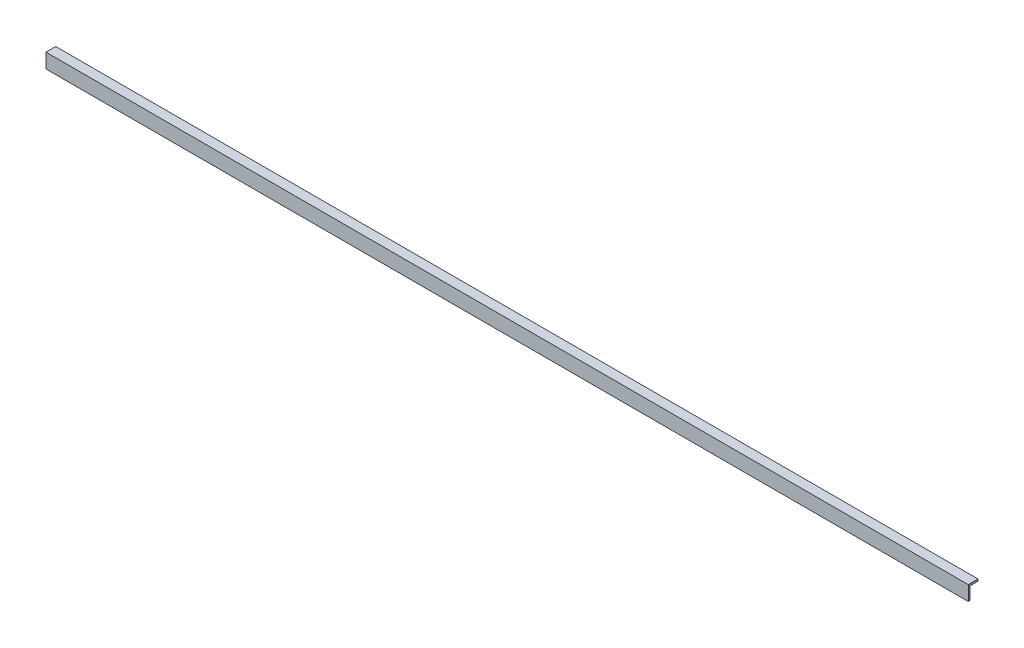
ISO-10303-21;
HEADER;
FILE_DESCRIPTION(('STEP AP214'),'2;1');
FILE_NAME('part.step','',(''),(''),'','','');
FILE_SCHEMA(('AUTOMOTIVE_DESIGN { 1 0 10303 214 1 1 1 1 }'));
ENDSEC;
DATA;
#1=APPLICATION_CONTEXT('core data for automotive mechanical design processes');
#2=APPLICATION_PROTOCOL_DEFINITION('international standard','automotive_design',2000,#1);
#3=PRODUCT_CONTEXT('',#1,'mechanical');
#4=PRODUCT('Part','Part','',(#3));
#5=PRODUCT_RELATED_PRODUCT_CATEGORY('part','',(#4));
#6=PRODUCT_DEFINITION_FORMATION('','',#4);
#7=PRODUCT_DEFINITION_CONTEXT('part definition',#1,'design');
#8=PRODUCT_DEFINITION('design','',#6,#7);
#9=PRODUCT_DEFINITION_SHAPE('','',#8);
#10=(LENGTH_UNIT() NAMED_UNIT(*) SI_UNIT(.MILLI.,.METRE.));
#11=(NAMED_UNIT(*) PLANE_ANGLE_UNIT() SI_UNIT($,.RADIAN.));
#12=(NAMED_UNIT(*) SI_UNIT($,.STERADIAN.) SOLID_ANGLE_UNIT());
#13=UNCERTAINTY_MEASURE_WITH_UNIT(LENGTH_MEASURE(1.E-05),#10,'distance_accuracy_value','');
#14=(GEOMETRIC_REPRESENTATION_CONTEXT(3) GLOBAL_UNCERTAINTY_ASSIGNED_CONTEXT((#13)) GLOBAL_UNIT_ASSIGNED_CONTEXT((#10,
#11,#12)) REPRESENTATION_CONTEXT('',''));
#15=CARTESIAN_POINT('',(0.,0.,0.));
#16=DIRECTION('',(0.,0.,1.));
#17=DIRECTION('',(1.,0.,0.));
#18=AXIS2_PLACEMENT_3D('',#15,#16,#17);
#19=CARTESIAN_POINT('',(473.5,0.,0.));
#20=DIRECTION('',(0.,0.,-1.));
#21=DIRECTION('',(0.,1.,0.));
#22=AXIS2_PLACEMENT_3D('',#19,#20,#21);
#23=PLANE('',#22);
#24=DIRECTION('',(0.,-1.,0.));
#25=VECTOR('',#24,1.);
#26=CARTESIAN_POINT('',(-473.5,0.,0.));
#27=LINE('',#26,#25);
#28=CARTESIAN_POINT('',(-473.5,0.,0.));
#29=VERTEX_POINT('',#28);
#30=CARTESIAN_POINT('',(-473.5,-15.,0.));
#31=VERTEX_POINT('',#30);
#32=EDGE_CURVE('E122',#29,#31,#27,.T.);
#33=ORIENTED_EDGE('',*,*,#32,.T.);
#34=DIRECTION('',(-1.,0.,0.));
#35=VECTOR('',#34,1.);
#36=CARTESIAN_POINT('',(473.5,-15.,0.));
#37=LINE('',#36,#35);
#38=CARTESIAN_POINT('',(473.5,-15.,0.));
#39=VERTEX_POINT('',#38);
#40=EDGE_CURVE('E11',#39,#31,#37,.T.);
#41=ORIENTED_EDGE('',*,*,#40,.F.);
#42=DIRECTION('',(0.,-1.,0.));
#43=VECTOR('',#42,1.);
#44=CARTESIAN_POINT('',(473.5,0.,0.));
#45=LINE('',#44,#43);
#46=CARTESIAN_POINT('',(473.5,0.,0.));
#47=VERTEX_POINT('',#46);
#48=EDGE_CURVE('E132',#47,#39,#45,.T.);
#49=ORIENTED_EDGE('',*,*,#48,.F.);
#50=DIRECTION('',(-1.,0.,0.));
#51=VECTOR('',#50,1.);
#52=CARTESIAN_POINT('',(473.5,0.,0.));
#53=LINE('',#52,#51);
#54=EDGE_CURVE('E118',#47,#29,#53,.T.);
#55=ORIENTED_EDGE('',*,*,#54,.T.);
#56=EDGE_LOOP('',(#33,#41,#49,#55));
#57=FACE_BOUND('',#56,.T.);
#58=ADVANCED_FACE('F36',(#57),#23,.F.);
#59=CARTESIAN_POINT('',(473.5,-15.,0.));
#60=DIRECTION('',(0.,1.,0.));
#61=DIRECTION('',(0.,0.,1.));
#62=AXIS2_PLACEMENT_3D('',#59,#60,#61);
#63=PLANE('',#62);
#64=DIRECTION('',(0.,0.,-1.));
#65=VECTOR('',#64,1.);
#66=CARTESIAN_POINT('',(-473.5,-15.,0.));
#67=LINE('',#66,#65);
#68=CARTESIAN_POINT('',(-473.5,-15.,-2.));
#69=VERTEX_POINT('',#68);
#70=EDGE_CURVE('E125',#31,#69,#67,.T.);
#71=ORIENTED_EDGE('',*,*,#70,.T.);
#72=DIRECTION('',(-1.,0.,0.));
#73=VECTOR('',#72,1.);
#74=CARTESIAN_POINT('',(473.5,-15.,-2.));
#75=LINE('',#74,#73);
#76=CARTESIAN_POINT('',(473.5,-15.,-2.));
#77=VERTEX_POINT('',#76);
#78=EDGE_CURVE('E45',#77,#69,#75,.T.);
#79=ORIENTED_EDGE('',*,*,#78,.F.);
#80=DIRECTION('',(0.,0.,-1.));
#81=VECTOR('',#80,1.);
#82=CARTESIAN_POINT('',(473.5,-15.,0.));
#83=LINE('',#82,#81);
#84=EDGE_CURVE('E90',#39,#77,#83,.T.);
#85=ORIENTED_EDGE('',*,*,#84,.F.);
#86=ORIENTED_EDGE('',*,*,#40,.T.);
#87=EDGE_LOOP('',(#71,#79,#85,#86));
#88=FACE_BOUND('',#87,.T.);
#89=ADVANCED_FACE('F160',(#88),#63,.F.);
#90=CARTESIAN_POINT('',(473.5,-15.,-2.));
#91=DIRECTION('',(0.,0.,1.));
#92=DIRECTION('',(1.,0.,0.));
#93=AXIS2_PLACEMENT_3D('',#90,#91,#92);
#94=PLANE('',#93);
#95=DIRECTION('',(0.,1.,0.));
#96=VECTOR('',#95,1.);
#97=CARTESIAN_POINT('',(-473.5,-15.,-2.));
#98=LINE('',#97,#96);
#99=CARTESIAN_POINT('',(-473.5,-2.,-2.));
#100=VERTEX_POINT('',#99);
#101=EDGE_CURVE('E127',#69,#100,#98,.T.);
#102=ORIENTED_EDGE('',*,*,#101,.T.);
#103=DIRECTION('',(-1.,0.,0.));
#104=VECTOR('',#103,1.);
#105=CARTESIAN_POINT('',(473.5,-2.,-2.));
#106=LINE('',#105,#104);
#107=CARTESIAN_POINT('',(473.5,-2.,-2.));
#108=VERTEX_POINT('',#107);
#109=EDGE_CURVE('E113',#108,#100,#106,.T.);
#110=ORIENTED_EDGE('',*,*,#109,.F.);
#111=DIRECTION('',(0.,1.,0.));
#112=VECTOR('',#111,1.);
#113=CARTESIAN_POINT('',(473.5,-15.,-2.));
#114=LINE('',#113,#112);
#115=EDGE_CURVE('E103',#77,#108,#114,.T.);
#116=ORIENTED_EDGE('',*,*,#115,.F.);
#117=ORIENTED_EDGE('',*,*,#78,.T.);
#118=EDGE_LOOP('',(#102,#110,#116,#117));
#119=FACE_BOUND('',#118,.T.);
#120=ADVANCED_FACE('F142',(#119),#94,.F.);
#121=CARTESIAN_POINT('',(473.5,-2.,-10.));
#122=DIRECTION('',(0.,1.,0.));
#123=DIRECTION('',(0.,0.,1.));
#124=AXIS2_PLACEMENT_3D('',#121,#122,#123);
#125=PLANE('',#124);
#126=DIRECTION('',(0.,0.,-1.));
#127=VECTOR('',#126,1.);
#128=CARTESIAN_POINT('',(-473.5,-2.,-10.));
#129=LINE('',#128,#127);
#130=CARTESIAN_POINT('',(-473.5,-2.,-10.));
#131=VERTEX_POINT('',#130);
#132=EDGE_CURVE('E111',#100,#131,#129,.T.);
#133=ORIENTED_EDGE('',*,*,#132,.T.);
#134=DIRECTION('',(-1.,0.,0.));
#135=VECTOR('',#134,1.);
#136=CARTESIAN_POINT('',(473.5,-2.,-10.));
#137=LINE('',#136,#135);
#138=CARTESIAN_POINT('',(473.5,-2.,-10.));
#139=VERTEX_POINT('',#138);
#140=EDGE_CURVE('E108',#139,#131,#137,.T.);
#141=ORIENTED_EDGE('',*,*,#140,.F.);
#142=DIRECTION('',(0.,0.,-1.));
#143=VECTOR('',#142,1.);
#144=CARTESIAN_POINT('',(473.5,-2.,-10.));
#145=LINE('',#144,#143);
#146=EDGE_CURVE('E97',#108,#139,#145,.T.);
#147=ORIENTED_EDGE('',*,*,#146,.F.);
#148=ORIENTED_EDGE('',*,*,#109,.T.);
#149=EDGE_LOOP('',(#133,#141,#147,#148));
#150=FACE_BOUND('',#149,.T.);
#151=ADVANCED_FACE('F109',(#150),#125,.F.);
#152=CARTESIAN_POINT('',(473.5,0.,-10.));
#153=DIRECTION('',(0.,0.,1.));
#154=DIRECTION('',(1.,0.,0.));
#155=AXIS2_PLACEMENT_3D('',#152,#153,#154);
#156=PLANE('',#155);
#157=DIRECTION('',(0.,1.,0.));
#158=VECTOR('',#157,1.);
#159=CARTESIAN_POINT('',(-473.5,0.,-10.));
#160=LINE('',#159,#158);
#161=CARTESIAN_POINT('',(-473.5,0.,-10.));
#162=VERTEX_POINT('',#161);
#163=EDGE_CURVE('E76',#131,#162,#160,.T.);
#164=ORIENTED_EDGE('',*,*,#163,.T.);
#165=DIRECTION('',(-1.,0.,0.));
#166=VECTOR('',#165,1.);
#167=CARTESIAN_POINT('',(473.5,0.,-10.));
#168=LINE('',#167,#166);
#169=CARTESIAN_POINT('',(473.5,0.,-10.));
#170=VERTEX_POINT('',#169);
#171=EDGE_CURVE('E114',#170,#162,#168,.T.);
#172=ORIENTED_EDGE('',*,*,#171,.F.);
#173=DIRECTION('',(0.,1.,0.));
#174=VECTOR('',#173,1.);
#175=CARTESIAN_POINT('',(473.5,0.,-10.));
#176=LINE('',#175,#174);
#177=EDGE_CURVE('E101',#139,#170,#176,.T.);
#178=ORIENTED_EDGE('',*,*,#177,.F.);
#179=ORIENTED_EDGE('',*,*,#140,.T.);
#180=EDGE_LOOP('',(#164,#172,#178,#179));
#181=FACE_BOUND('',#180,.T.);
#182=ADVANCED_FACE('F116',(#181),#156,.F.);
#183=CARTESIAN_POINT('',(473.5,0.,0.));
#184=DIRECTION('',(0.,-1.,0.));
#185=DIRECTION('',(0.,0.,-1.));
#186=AXIS2_PLACEMENT_3D('',#183,#184,#185);
#187=PLANE('',#186);
#188=DIRECTION('',(0.,0.,1.));
#189=VECTOR('',#188,1.);
#190=CARTESIAN_POINT('',(-473.5,0.,0.));
#191=LINE('',#190,#189);
#192=EDGE_CURVE('E82',#162,#29,#191,.T.);
#193=ORIENTED_EDGE('',*,*,#192,.T.);
#194=ORIENTED_EDGE('',*,*,#54,.F.);
#195=DIRECTION('',(0.,0.,1.));
#196=VECTOR('',#195,1.);
#197=CARTESIAN_POINT('',(473.5,0.,0.));
#198=LINE('',#197,#196);
#199=EDGE_CURVE('E53',#170,#47,#198,.T.);
#200=ORIENTED_EDGE('',*,*,#199,.F.);
#201=ORIENTED_EDGE('',*,*,#171,.T.);
#202=EDGE_LOOP('',(#193,#194,#200,#201));
#203=FACE_BOUND('',#202,.T.);
#204=ADVANCED_FACE('F149',(#203),#187,.F.);
#205=CARTESIAN_POINT('',(473.5,0.,0.));
#206=DIRECTION('',(1.,0.,0.));
#207=DIRECTION('',(0.,0.,-1.));
#208=AXIS2_PLACEMENT_3D('',#205,#206,#207);
#209=PLANE('',#208);
#210=ORIENTED_EDGE('',*,*,#48,.T.);
#211=ORIENTED_EDGE('',*,*,#84,.T.);
#212=ORIENTED_EDGE('',*,*,#115,.T.);
#213=ORIENTED_EDGE('',*,*,#146,.T.);
#214=ORIENTED_EDGE('',*,*,#177,.T.);
#215=ORIENTED_EDGE('',*,*,#199,.T.);
#216=EDGE_LOOP('',(#210,#211,#212,#213,#214,#215));
#217=FACE_BOUND('',#216,.T.);
#218=ADVANCED_FACE('F99',(#217),#209,.T.);
#219=CARTESIAN_POINT('',(-473.5,0.,0.));
#220=DIRECTION('',(1.,0.,0.));
#221=DIRECTION('',(0.,0.,-1.));
#222=AXIS2_PLACEMENT_3D('',#219,#220,#221);
#223=PLANE('',#222);
#224=ORIENTED_EDGE('',*,*,#32,.F.);
#225=ORIENTED_EDGE('',*,*,#192,.F.);
#226=ORIENTED_EDGE('',*,*,#163,.F.);
#227=ORIENTED_EDGE('',*,*,#132,.F.);
#228=ORIENTED_EDGE('',*,*,#101,.F.);
#229=ORIENTED_EDGE('',*,*,#70,.F.);
#230=EDGE_LOOP('',(#224,#225,#226,#227,#228,#229));
#231=FACE_BOUND('',#230,.T.);
#232=ADVANCED_FACE('F145',(#231),#223,.F.);
#233=CLOSED_SHELL('',(#58,#89,#120,#151,#182,#204,#218,#232));
#234=MANIFOLD_SOLID_BREP('B2',#233);
#235=ADVANCED_BREP_SHAPE_REPRESENTATION('',(#18,#234),#14);
#236=SHAPE_DEFINITION_REPRESENTATION(#9,#235);
ENDSEC;
END-ISO-10303-21;
